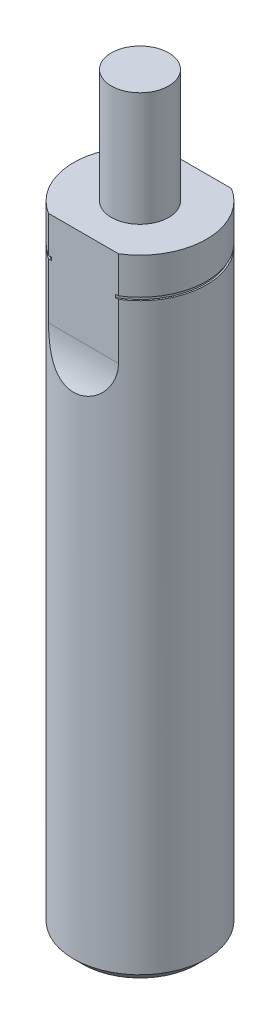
ISO-10303-21;
HEADER;
FILE_DESCRIPTION(('STEP AP214'),'2;1');
FILE_NAME('part.step','',(''),(''),'','','');
FILE_SCHEMA(('AUTOMOTIVE_DESIGN { 1 0 10303 214 1 1 1 1 }'));
ENDSEC;
DATA;
#1=APPLICATION_CONTEXT('core data for automotive mechanical design processes');
#2=APPLICATION_PROTOCOL_DEFINITION('international standard','automotive_design',2000,#1);
#3=PRODUCT_CONTEXT('',#1,'mechanical');
#4=PRODUCT('Part','Part','',(#3));
#5=PRODUCT_RELATED_PRODUCT_CATEGORY('part','',(#4));
#6=PRODUCT_DEFINITION_FORMATION('','',#4);
#7=PRODUCT_DEFINITION_CONTEXT('part definition',#1,'design');
#8=PRODUCT_DEFINITION('design','',#6,#7);
#9=PRODUCT_DEFINITION_SHAPE('','',#8);
#10=(LENGTH_UNIT() NAMED_UNIT(*) SI_UNIT(.MILLI.,.METRE.));
#11=(NAMED_UNIT(*) PLANE_ANGLE_UNIT() SI_UNIT($,.RADIAN.));
#12=(NAMED_UNIT(*) SI_UNIT($,.STERADIAN.) SOLID_ANGLE_UNIT());
#13=UNCERTAINTY_MEASURE_WITH_UNIT(LENGTH_MEASURE(1.E-05),#10,'distance_accuracy_value','');
#14=(GEOMETRIC_REPRESENTATION_CONTEXT(3) GLOBAL_UNCERTAINTY_ASSIGNED_CONTEXT((#13)) GLOBAL_UNIT_ASSIGNED_CONTEXT((#10,
#11,#12)) REPRESENTATION_CONTEXT('',''));
#15=CARTESIAN_POINT('',(0.,0.,0.));
#16=DIRECTION('',(0.,0.,1.));
#17=DIRECTION('',(1.,0.,0.));
#18=AXIS2_PLACEMENT_3D('',#15,#16,#17);
#19=CARTESIAN_POINT('',(0.,52.9082,0.));
#20=DIRECTION('',(0.,-1.,0.));
#21=DIRECTION('',(0.,0.,-1.));
#22=AXIS2_PLACEMENT_3D('',#19,#20,#21);
#23=CYLINDRICAL_SURFACE('',#22,5.55625);
#24=CARTESIAN_POINT('',(0.,0.793750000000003,0.));
#25=DIRECTION('',(0.,1.,0.));
#26=DIRECTION('',(0.,0.,1.));
#27=AXIS2_PLACEMENT_3D('',#24,#25,#26);
#28=CIRCLE('',#27,5.55625);
#29=CARTESIAN_POINT('',(0.,0.793750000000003,5.55625));
#30=VERTEX_POINT('',#29);
#31=EDGE_CURVE('E40',#30,#30,#28,.T.);
#32=ORIENTED_EDGE('',*,*,#31,.T.);
#33=EDGE_LOOP('',(#32));
#34=FACE_BOUND('',#33,.T.);
#35=DIRECTION('',(0.,-1.,0.));
#36=VECTOR('',#35,1.);
#37=CARTESIAN_POINT('',(2.92437321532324,52.9082,-4.7244));
#38=LINE('',#37,#36);
#39=CARTESIAN_POINT('',(2.92437321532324,44.9707,-4.7244));
#40=VERTEX_POINT('',#39);
#41=CARTESIAN_POINT('',(2.92437321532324,49.6062,-4.7244));
#42=VERTEX_POINT('',#41);
#43=EDGE_CURVE('E176',#40,#42,#38,.F.);
#44=ORIENTED_EDGE('',*,*,#43,.T.);
#45=CARTESIAN_POINT('',(0.,49.6062,0.));
#46=DIRECTION('',(0.,-1.,0.));
#47=DIRECTION('',(0.,0.,-1.));
#48=AXIS2_PLACEMENT_3D('',#45,#46,#47);
#49=CIRCLE('',#48,5.55625);
#50=CARTESIAN_POINT('',(2.92437321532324,49.6062,4.7244));
#51=VERTEX_POINT('',#50);
#52=EDGE_CURVE('E146',#42,#51,#49,.T.);
#53=ORIENTED_EDGE('',*,*,#52,.T.);
#54=DIRECTION('',(0.,-1.,0.));
#55=VECTOR('',#54,1.);
#56=CARTESIAN_POINT('',(2.92437321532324,52.9082,4.7244));
#57=LINE('',#56,#55);
#58=CARTESIAN_POINT('',(2.92437321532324,44.9707,4.7244));
#59=VERTEX_POINT('',#58);
#60=EDGE_CURVE('E276',#51,#59,#57,.T.);
#61=ORIENTED_EDGE('',*,*,#60,.T.);
#62=CARTESIAN_POINT('',(-2.92437321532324,44.9707,4.7244));
#63=CARTESIAN_POINT('',(-2.92437357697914,45.1465694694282,4.7244066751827));
#64=CARTESIAN_POINT('',(-2.9125849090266,45.3225270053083,4.73176007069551));
#65=CARTESIAN_POINT('',(-2.86515397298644,45.6701491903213,4.76062580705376));
#66=CARTESIAN_POINT('',(-2.82949078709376,45.8418099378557,4.78215056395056));
#67=CARTESIAN_POINT('',(-2.73358599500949,46.1764199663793,4.83761206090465));
#68=CARTESIAN_POINT('',(-2.67330208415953,46.3393537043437,4.87157015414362));
#69=CARTESIAN_POINT('',(-2.52764479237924,46.6512232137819,4.94870519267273));
#70=CARTESIAN_POINT('',(-2.4422819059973,46.8001648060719,4.99187827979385));
#71=CARTESIAN_POINT('',(-2.24736833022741,47.0782932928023,5.08258637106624));
#72=CARTESIAN_POINT('',(-2.1379810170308,47.2076040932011,5.13009070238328));
#73=CARTESIAN_POINT('',(-1.89643821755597,47.4432865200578,5.22418946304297));
#74=CARTESIAN_POINT('',(-1.76429080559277,47.5496662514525,5.2707842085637));
#75=CARTESIAN_POINT('',(-1.49144964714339,47.7292582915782,5.35408923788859));
#76=CARTESIAN_POINT('',(-1.3521446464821,47.8043624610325,5.39127921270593));
#77=CARTESIAN_POINT('',(-1.06102493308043,47.9306947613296,5.45603699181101));
#78=CARTESIAN_POINT('',(-0.909212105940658,47.9819264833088,5.48360624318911));
#79=CARTESIAN_POINT('',(-0.603842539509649,48.0582552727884,5.52540635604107));
#80=CARTESIAN_POINT('',(-0.450585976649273,48.0842957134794,5.54011651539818));
#81=CARTESIAN_POINT('',(-0.141222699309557,48.1134411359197,5.55661357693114));
#82=CARTESIAN_POINT('',(0.0148838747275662,48.1165472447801,5.55840111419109));
#83=CARTESIAN_POINT('',(0.324473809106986,48.0998552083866,5.54891600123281));
#84=CARTESIAN_POINT('',(0.477967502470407,48.0802013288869,5.53772561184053));
#85=CARTESIAN_POINT('',(0.778964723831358,48.0183815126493,5.50345990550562));
#86=CARTESIAN_POINT('',(0.926468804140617,47.9762176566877,5.48038568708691));
#87=CARTESIAN_POINT('',(1.21138937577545,47.8698499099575,5.42453149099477));
#88=CARTESIAN_POINT('',(1.34880290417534,47.8056395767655,5.39174867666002));
#89=CARTESIAN_POINT('',(1.60981031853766,47.6562737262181,5.31965944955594));
#90=CARTESIAN_POINT('',(1.73340484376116,47.5711191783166,5.28035333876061));
#91=CARTESIAN_POINT('',(1.96521224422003,47.38067418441,5.19857267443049));
#92=CARTESIAN_POINT('',(2.07323828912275,47.2751698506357,5.15606768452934));
#93=CARTESIAN_POINT('',(2.27040287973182,47.0473692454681,5.07234556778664));
#94=CARTESIAN_POINT('',(2.35953739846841,46.9250694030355,5.03112871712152));
#95=CARTESIAN_POINT('',(2.52176099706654,46.6610152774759,4.95188692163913));
#96=CARTESIAN_POINT('',(2.59392913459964,46.5186268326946,4.91409436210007));
#97=CARTESIAN_POINT('',(2.71679007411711,46.2229582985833,4.84725379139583));
#98=CARTESIAN_POINT('',(2.7674747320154,46.0696741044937,4.81820909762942));
#99=CARTESIAN_POINT('',(2.85087623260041,45.7441689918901,4.76937689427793));
#100=CARTESIAN_POINT('',(2.88193926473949,45.5713934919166,4.75045829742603));
#101=CARTESIAN_POINT('',(2.92030459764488,45.2222424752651,4.7269686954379));
#102=CARTESIAN_POINT('',(2.92759749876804,45.0458655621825,4.72240336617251));
#103=CARTESIAN_POINT('',(2.91830118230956,44.6837365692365,4.72815891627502));
#104=CARTESIAN_POINT('',(2.90030750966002,44.4980317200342,4.7393552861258));
#105=CARTESIAN_POINT('',(2.83745730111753,44.1328071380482,4.77724658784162));
#106=CARTESIAN_POINT('',(2.79259921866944,43.9532877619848,4.80394241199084));
#107=CARTESIAN_POINT('',(2.67555375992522,43.6068841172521,4.87009291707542));
#108=CARTESIAN_POINT('',(2.60350989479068,43.4399389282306,4.90948044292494));
#109=CARTESIAN_POINT('',(2.43167949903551,43.1234619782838,4.99680665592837));
#110=CARTESIAN_POINT('',(2.33190910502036,42.9739201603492,5.04474036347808));
#111=CARTESIAN_POINT('',(2.11321739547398,42.7070865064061,5.13998268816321));
#112=CARTESIAN_POINT('',(1.99604770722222,42.5882975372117,5.1871143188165));
#113=CARTESIAN_POINT('',(1.74074728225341,42.374395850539,5.27825808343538));
#114=CARTESIAN_POINT('',(1.60262546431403,42.2792731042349,5.32227153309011));
#115=CARTESIAN_POINT('',(1.3201414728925,42.121265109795,5.39897894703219));
#116=CARTESIAN_POINT('',(1.1769679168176,42.0565355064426,5.4322641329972));
#117=CARTESIAN_POINT('',(0.880165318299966,41.9507447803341,5.48816896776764));
#118=CARTESIAN_POINT('',(0.726537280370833,41.9096813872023,5.51078963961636));
#119=CARTESIAN_POINT('',(0.418236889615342,41.8525911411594,5.54258858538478));
#120=CARTESIAN_POINT('',(0.26373704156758,41.8358437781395,5.55215318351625));
#121=CARTESIAN_POINT('',(-0.0463012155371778,41.8251805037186,5.55821935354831));
#122=CARTESIAN_POINT('',(-0.201839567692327,41.8312633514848,5.55472163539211));
#123=CARTESIAN_POINT('',(-0.508961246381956,41.8661573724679,5.53502221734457));
#124=CARTESIAN_POINT('',(-0.660556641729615,41.8948878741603,5.51886560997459));
#125=CARTESIAN_POINT('',(-0.956051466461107,41.9747145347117,5.47541628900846));
#126=CARTESIAN_POINT('',(-1.09995162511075,42.0258085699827,5.44812463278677));
#127=CARTESIAN_POINT('',(-1.37621358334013,42.14973076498,5.38498490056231));
#128=CARTESIAN_POINT('',(-1.50856348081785,42.2225810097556,5.3491281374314));
#129=CARTESIAN_POINT('',(-1.75815838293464,42.3885966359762,5.27236820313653));
#130=CARTESIAN_POINT('',(-1.87540401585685,42.4817611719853,5.23146524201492));
#131=CARTESIAN_POINT('',(-2.09411253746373,42.6878781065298,5.14786995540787));
#132=CARTESIAN_POINT('',(-2.19528765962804,42.8011277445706,5.10515934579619));
#133=CARTESIAN_POINT('',(-2.37811663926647,43.0433558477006,5.02260592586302));
#134=CARTESIAN_POINT('',(-2.45976172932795,43.1723413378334,4.9827644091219));
#135=CARTESIAN_POINT('',(-2.60695950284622,43.44991271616,4.90743346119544));
#136=CARTESIAN_POINT('',(-2.67140051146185,43.5991819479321,4.87229682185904));
#137=CARTESIAN_POINT('',(-2.77833602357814,43.9072069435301,4.81212509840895));
#138=CARTESIAN_POINT('',(-2.8208400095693,44.0659585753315,4.78708565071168));
#139=CARTESIAN_POINT('',(-2.8766454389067,44.349232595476,4.75369094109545));
#140=CARTESIAN_POINT('',(-2.89455737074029,44.472574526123,4.74274727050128));
#141=CARTESIAN_POINT('',(-2.91842126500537,44.7208294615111,4.72809934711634));
#142=CARTESIAN_POINT('',(-2.92437295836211,44.8457425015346,4.72439525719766));
#143=CARTESIAN_POINT('',(-2.92437321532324,44.9707,4.7244));
#144=B_SPLINE_CURVE_WITH_KNOTS('',3,(#62,#63,#64,#65,#66,#67,#68,#69,#70,#71,#72,#73,#74,#75,
#76,#77,#78,#79,#80,#81,#82,#83,#84,#85,#86,#87,#88,#89,#90,#91,#92,#93,#94,#95,#96,#97,#98,#99,
#100,#101,#102,#103,#104,#105,#106,#107,#108,#109,#110,#111,#112,#113,#114,#115,#116,#117,#118,
#119,#120,#121,#122,#123,#124,#125,#126,#127,#128,#129,#130,#131,#132,#133,#134,#135,#136,#137,
#138,#139,#140,#141,#142,#143),.UNSPECIFIED.,.T.,.F.,(4,2,2,2,2,2,2,2,2,2,2,2,2,2,2,2,2,2,2,2,2,
2,2,2,2,2,2,2,2,2,2,2,2,2,2,2,2,2,2,2,4),(0.,0.527209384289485,1.05488129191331,
1.58346371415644,2.11182526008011,2.63669923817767,3.16138739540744,3.64664185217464,
4.13182328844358,4.59803781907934,5.06422943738,5.52748216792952,5.99069208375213,
6.45403747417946,6.91736142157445,7.38585039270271,7.85443912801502,8.34447159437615,
8.83468965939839,9.36207837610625,9.88967561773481,10.4477616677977,11.0058798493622,
11.5610920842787,12.1159818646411,12.633342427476,13.1504833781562,13.6299314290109,
14.1093334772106,14.5742180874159,15.0390774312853,15.5022883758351,15.9654553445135,
16.4290940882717,16.8927135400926,17.3638747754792,17.835247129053,18.3321607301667,
18.8288593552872,19.203439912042,19.5780288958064),.UNSPECIFIED.);
#145=CARTESIAN_POINT('',(-2.92437321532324,44.9707,4.7244));
#146=VERTEX_POINT('',#145);
#147=EDGE_CURVE('E277',#59,#146,#144,.T.);
#148=ORIENTED_EDGE('',*,*,#147,.T.);
#149=DIRECTION('',(0.,-1.,0.));
#150=VECTOR('',#149,1.);
#151=CARTESIAN_POINT('',(-2.92437321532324,52.9082,4.7244));
#152=LINE('',#151,#150);
#153=CARTESIAN_POINT('',(-2.92437321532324,49.6062,4.7244));
#154=VERTEX_POINT('',#153);
#155=EDGE_CURVE('E255',#146,#154,#152,.F.);
#156=ORIENTED_EDGE('',*,*,#155,.T.);
#157=CARTESIAN_POINT('',(-2.92437321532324,49.6062,-4.7244));
#158=VERTEX_POINT('',#157);
#159=EDGE_CURVE('E239',#154,#158,#49,.T.);
#160=ORIENTED_EDGE('',*,*,#159,.T.);
#161=DIRECTION('',(0.,-1.,0.));
#162=VECTOR('',#161,1.);
#163=CARTESIAN_POINT('',(-2.92437321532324,52.9082,-4.7244));
#164=LINE('',#163,#162);
#165=CARTESIAN_POINT('',(-2.92437321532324,44.9707,-4.7244));
#166=VERTEX_POINT('',#165);
#167=EDGE_CURVE('E185',#158,#166,#164,.T.);
#168=ORIENTED_EDGE('',*,*,#167,.T.);
#169=CARTESIAN_POINT('',(0.,48.1127567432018,-5.55625));
#170=CARTESIAN_POINT('',(-0.16184301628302,48.1127524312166,-5.55624008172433));
#171=CARTESIAN_POINT('',(-0.3238657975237,48.1003134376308,-5.54910680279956));
#172=CARTESIAN_POINT('',(-0.64304583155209,48.0505982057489,-5.52124723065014));
#173=CARTESIAN_POINT('',(-0.800194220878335,48.0132792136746,-5.50049753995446));
#174=CARTESIAN_POINT('',(-1.10442260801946,47.9142295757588,-5.44756580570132));
#175=CARTESIAN_POINT('',(-1.25151123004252,47.852520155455,-5.41539370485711));
#176=CARTESIAN_POINT('',(-1.53125541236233,47.7057761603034,-5.34303861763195));
#177=CARTESIAN_POINT('',(-1.66391899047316,47.6207546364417,-5.30286011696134));
#178=CARTESIAN_POINT('',(-1.90681674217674,47.4329055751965,-5.22032965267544));
#179=CARTESIAN_POINT('',(-2.01769920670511,47.3308532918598,-5.17811311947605));
#180=CARTESIAN_POINT('',(-2.2209059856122,47.1095192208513,-5.09427133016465));
#181=CARTESIAN_POINT('',(-2.31322781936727,46.9902351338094,-5.0526461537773));
#182=CARTESIAN_POINT('',(-2.48187123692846,46.7322144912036,-4.97205828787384));
#183=CARTESIAN_POINT('',(-2.55734474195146,46.5928661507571,-4.93328428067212));
#184=CARTESIAN_POINT('',(-2.68700080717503,46.3027140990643,-4.86388347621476));
#185=CARTESIAN_POINT('',(-2.74117510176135,46.1519059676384,-4.83325984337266));
#186=CARTESIAN_POINT('',(-2.83190980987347,45.8310972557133,-4.78070911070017));
#187=CARTESIAN_POINT('',(-2.8668523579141,45.6605044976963,-4.75960242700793));
#188=CARTESIAN_POINT('',(-2.91320994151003,45.3150001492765,-4.73136886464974));
#189=CARTESIAN_POINT('',(-2.92461561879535,45.1400868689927,-4.72424754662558));
#190=CARTESIAN_POINT('',(-2.92410787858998,44.7794914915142,-4.72456679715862));
#191=CARTESIAN_POINT('',(-2.91071509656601,44.5938095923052,-4.7329311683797));
#192=CARTESIAN_POINT('',(-2.85733623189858,44.2276647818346,-4.76534447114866));
#193=CARTESIAN_POINT('',(-2.81734718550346,44.0472024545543,-4.78939515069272));
#194=CARTESIAN_POINT('',(-2.70996767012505,43.6967429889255,-4.85095996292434));
#195=CARTESIAN_POINT('',(-2.64254656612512,43.5267577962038,-4.88848914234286));
#196=CARTESIAN_POINT('',(-2.47977257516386,43.2033094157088,-4.97302711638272));
#197=CARTESIAN_POINT('',(-2.38443495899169,43.0498372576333,-5.02003072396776));
#198=CARTESIAN_POINT('',(-2.17343135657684,42.7741384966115,-5.11473992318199));
#199=CARTESIAN_POINT('',(-2.0594507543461,42.6505429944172,-5.1622093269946));
#200=CARTESIAN_POINT('',(-1.80966659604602,42.4268017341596,-5.25496818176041));
#201=CARTESIAN_POINT('',(-1.67387321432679,42.3266450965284,-5.30025863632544));
#202=CARTESIAN_POINT('',(-1.39521071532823,42.159186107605,-5.38002734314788));
#203=CARTESIAN_POINT('',(-1.25364185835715,42.0899793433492,-5.41506258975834));
#204=CARTESIAN_POINT('',(-0.959160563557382,41.9753290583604,-5.47489432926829));
#205=CARTESIAN_POINT('',(-0.806249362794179,41.9298829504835,-5.49969193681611));
#206=CARTESIAN_POINT('',(-0.49908802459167,41.8644776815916,-5.53587684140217));
#207=CARTESIAN_POINT('',(-0.34506106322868,41.8437028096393,-5.54769230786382));
#208=CARTESIAN_POINT('',(-0.035184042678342,41.825026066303,-5.55830021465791));
#209=CARTESIAN_POINT('',(0.1206659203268,41.8271229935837,-5.55709333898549));
#210=CARTESIAN_POINT('',(0.429009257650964,41.8541138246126,-5.54180362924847));
#211=CARTESIAN_POINT('',(0.581514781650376,41.8789027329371,-5.5277800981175));
#212=CARTESIAN_POINT('',(0.879565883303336,41.9509169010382,-5.48824911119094));
#213=CARTESIAN_POINT('',(1.02511214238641,41.9981399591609,-5.46274278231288));
#214=CARTESIAN_POINT('',(1.30527948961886,42.1144609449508,-5.40265785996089));
#215=CARTESIAN_POINT('',(1.43989343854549,42.1835730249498,-5.3680733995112));
#216=CARTESIAN_POINT('',(1.69456253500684,42.3424016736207,-5.29320429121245));
#217=CARTESIAN_POINT('',(1.81461802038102,42.432117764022,-5.25291977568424));
#218=CARTESIAN_POINT('',(2.03909906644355,42.6314845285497,-5.16996487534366));
#219=CARTESIAN_POINT('',(2.14328333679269,42.7413957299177,-5.12726905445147));
#220=CARTESIAN_POINT('',(2.33238198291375,42.977403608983,-5.0440669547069));
#221=CARTESIAN_POINT('',(2.41729170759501,43.1035041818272,-5.00356120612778));
#222=CARTESIAN_POINT('',(2.5710408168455,43.3752191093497,-4.92640433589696));
#223=CARTESIAN_POINT('',(2.6388551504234,43.5214964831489,-4.89005019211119));
#224=CARTESIAN_POINT('',(2.75277286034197,43.8241992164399,-4.82684250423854));
#225=CARTESIAN_POINT('',(2.79886782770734,43.9806284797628,-4.79999264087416));
#226=CARTESIAN_POINT('',(2.87257244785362,44.3119781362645,-4.75628464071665));
#227=CARTESIAN_POINT('',(2.89849399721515,44.4873967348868,-4.74035033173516));
#228=CARTESIAN_POINT('',(2.92625982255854,44.8408682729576,-4.72325887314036));
#229=CARTESIAN_POINT('',(2.92809485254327,45.0189221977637,-4.7221073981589));
#230=CARTESIAN_POINT('',(2.90717540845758,45.3824312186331,-4.73502111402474));
#231=CARTESIAN_POINT('',(2.88312982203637,45.5677863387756,-4.74988532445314));
#232=CARTESIAN_POINT('',(2.80784529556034,45.931032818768,-4.79477069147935));
#233=CARTESIAN_POINT('',(2.75660662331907,46.108924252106,-4.82479169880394));
#234=CARTESIAN_POINT('',(2.62704287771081,46.4492745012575,-4.89652384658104));
#235=CARTESIAN_POINT('',(2.54909043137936,46.6119083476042,-4.93807274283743));
#236=CARTESIAN_POINT('',(2.36579491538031,46.9186558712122,-5.02844913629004));
#237=CARTESIAN_POINT('',(2.26047045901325,47.0627820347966,-5.07727167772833));
#238=CARTESIAN_POINT('',(2.03228660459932,47.3177318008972,-5.17260565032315));
#239=CARTESIAN_POINT('',(1.91123611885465,47.4302061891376,-5.21903032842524));
#240=CARTESIAN_POINT('',(1.64928652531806,47.6313111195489,-5.30761846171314));
#241=CARTESIAN_POINT('',(1.50838750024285,47.7199417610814,-5.34978193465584));
#242=CARTESIAN_POINT('',(1.22124436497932,47.8658704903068,-5.42225934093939));
#243=CARTESIAN_POINT('',(1.07603114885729,47.9249017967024,-5.45318801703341));
#244=CARTESIAN_POINT('',(0.776439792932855,48.0193121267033,-5.50381923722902));
#245=CARTESIAN_POINT('',(0.622078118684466,48.0547323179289,-5.5235413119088));
#246=CARTESIAN_POINT('',(0.388680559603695,48.0897134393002,-5.54317965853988));
#247=CARTESIAN_POINT('',(0.311293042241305,48.0983500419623,-5.54806747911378));
#248=CARTESIAN_POINT('',(0.155950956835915,48.1098729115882,-5.55460514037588));
#249=CARTESIAN_POINT('',(0.077996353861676,48.1127588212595,-5.5562547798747));
#250=CARTESIAN_POINT('',(0.,48.1127567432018,-5.55625));
#251=B_SPLINE_CURVE_WITH_KNOTS('',3,(#169,#170,#171,#172,#173,#174,#175,#176,#177,#178,#179,
#180,#181,#182,#183,#184,#185,#186,#187,#188,#189,#190,#191,#192,#193,#194,#195,#196,#197,#198,
#199,#200,#201,#202,#203,#204,#205,#206,#207,#208,#209,#210,#211,#212,#213,#214,#215,#216,#217,
#218,#219,#220,#221,#222,#223,#224,#225,#226,#227,#228,#229,#230,#231,#232,#233,#234,#235,#236,
#237,#238,#239,#240,#241,#242,#243,#244,#245,#246,#247,#248,#249,#250),.UNSPECIFIED.,.T.,.F.,(4,
2,2,2,2,2,2,2,2,2,2,2,2,2,2,2,2,2,2,2,2,2,2,2,2,2,2,2,2,2,2,2,2,2,2,2,2,2,2,2,4),(0.,
0.485211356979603,0.971258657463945,1.45688390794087,1.94223784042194,2.40963293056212,
2.87709044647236,3.36444061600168,3.85197972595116,4.37593442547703,4.9000974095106,
5.45654096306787,6.01304653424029,6.5701753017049,7.12699987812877,7.6482927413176,
8.16934315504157,8.65120587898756,9.1330161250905,9.59840845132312,10.0637763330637,
10.5270017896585,10.9901817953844,11.4536618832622,11.9171312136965,12.3870632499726,
12.8571085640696,13.3508331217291,13.8447486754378,14.3765303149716,14.9085160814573,
15.4683260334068,16.0281304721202,16.580424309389,17.1323435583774,17.6445179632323,
18.156690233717,18.6337034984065,19.1098828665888,19.3437042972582,19.5775402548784),.UNSPECIFIED.);
#252=EDGE_CURVE('E179',#166,#40,#251,.T.);
#253=ORIENTED_EDGE('',*,*,#252,.T.);
#254=EDGE_LOOP('',(#44,#53,#61,#148,#156,#160,#168,#253));
#255=FACE_BOUND('',#254,.T.);
#256=ADVANCED_FACE('F32',(#34,#255),#23,.T.);
#257=CARTESIAN_POINT('',(2.92437321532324,52.9082,4.7244));
#258=VERTEX_POINT('',#257);
#259=CARTESIAN_POINT('',(2.92437321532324,49.8602,4.7244));
#260=VERTEX_POINT('',#259);
#261=EDGE_CURVE('E273',#258,#260,#57,.T.);
#262=ORIENTED_EDGE('',*,*,#261,.T.);
#263=CARTESIAN_POINT('',(0.,49.8602,0.));
#264=DIRECTION('',(0.,-1.,0.));
#265=DIRECTION('',(0.,0.,-1.));
#266=AXIS2_PLACEMENT_3D('',#263,#264,#265);
#267=CIRCLE('',#266,5.55625);
#268=CARTESIAN_POINT('',(2.92437321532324,49.8602,-4.7244));
#269=VERTEX_POINT('',#268);
#270=EDGE_CURVE('E55',#269,#260,#267,.T.);
#271=ORIENTED_EDGE('',*,*,#270,.F.);
#272=CARTESIAN_POINT('',(2.92437321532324,52.9082,-4.7244));
#273=VERTEX_POINT('',#272);
#274=EDGE_CURVE('E142',#269,#273,#38,.F.);
#275=ORIENTED_EDGE('',*,*,#274,.T.);
#276=CARTESIAN_POINT('',(0.,52.9082,0.));
#277=DIRECTION('',(0.,1.,0.));
#278=DIRECTION('',(0.,0.,1.));
#279=AXIS2_PLACEMENT_3D('',#276,#277,#278);
#280=CIRCLE('',#279,5.55625);
#281=EDGE_CURVE('E170',#258,#273,#280,.T.);
#282=ORIENTED_EDGE('',*,*,#281,.F.);
#283=EDGE_LOOP('',(#262,#271,#275,#282));
#284=FACE_BOUND('',#283,.T.);
#285=ADVANCED_FACE('F213',(#284),#23,.T.);
#286=CARTESIAN_POINT('',(0.,52.9082,0.));
#287=DIRECTION('',(0.,1.,0.));
#288=DIRECTION('',(0.,0.,1.));
#289=AXIS2_PLACEMENT_3D('',#286,#287,#288);
#290=PLANE('',#289);
#291=DIRECTION('',(1.,0.,0.));
#292=VECTOR('',#291,1.);
#293=CARTESIAN_POINT('',(-5.55625,52.9082,4.7244));
#294=LINE('',#293,#292);
#295=CARTESIAN_POINT('',(-2.92437321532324,52.9082,4.7244));
#296=VERTEX_POINT('',#295);
#297=EDGE_CURVE('E155',#296,#258,#294,.T.);
#298=ORIENTED_EDGE('',*,*,#297,.T.);
#299=ORIENTED_EDGE('',*,*,#281,.T.);
#300=DIRECTION('',(1.,0.,0.));
#301=VECTOR('',#300,1.);
#302=CARTESIAN_POINT('',(-5.55625,52.9082,-4.7244));
#303=LINE('',#302,#301);
#304=CARTESIAN_POINT('',(-2.92437321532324,52.9082,-4.7244));
#305=VERTEX_POINT('',#304);
#306=EDGE_CURVE('E158',#305,#273,#303,.T.);
#307=ORIENTED_EDGE('',*,*,#306,.F.);
#308=EDGE_CURVE('E173',#305,#296,#280,.T.);
#309=ORIENTED_EDGE('',*,*,#308,.T.);
#310=EDGE_LOOP('',(#298,#299,#307,#309));
#311=FACE_BOUND('',#310,.T.);
#312=CARTESIAN_POINT('',(0.,52.9082,0.));
#313=DIRECTION('',(0.,1.,0.));
#314=DIRECTION('',(0.,0.,1.));
#315=AXIS2_PLACEMENT_3D('',#312,#313,#314);
#316=CIRCLE('',#315,2.39776);
#317=CARTESIAN_POINT('',(0.,52.9082,-2.39776));
#318=VERTEX_POINT('',#317);
#319=EDGE_CURVE('E165',#318,#318,#316,.T.);
#320=ORIENTED_EDGE('',*,*,#319,.F.);
#321=EDGE_LOOP('',(#320));
#322=FACE_BOUND('',#321,.T.);
#323=ADVANCED_FACE('F211',(#311,#322),#290,.T.);
#324=CARTESIAN_POINT('',(-2.92437321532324,49.8602,-4.7244));
#325=VERTEX_POINT('',#324);
#326=EDGE_CURVE('E186',#305,#325,#164,.T.);
#327=ORIENTED_EDGE('',*,*,#326,.T.);
#328=CARTESIAN_POINT('',(-2.92437321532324,49.8602,4.7244));
#329=VERTEX_POINT('',#328);
#330=EDGE_CURVE('E244',#329,#325,#267,.T.);
#331=ORIENTED_EDGE('',*,*,#330,.F.);
#332=EDGE_CURVE('E254',#329,#296,#152,.F.);
#333=ORIENTED_EDGE('',*,*,#332,.T.);
#334=ORIENTED_EDGE('',*,*,#308,.F.);
#335=EDGE_LOOP('',(#327,#331,#333,#334));
#336=FACE_BOUND('',#335,.T.);
#337=ADVANCED_FACE('F188',(#336),#23,.T.);
#338=CARTESIAN_POINT('',(0.,0.,0.));
#339=DIRECTION('',(0.,1.,0.));
#340=DIRECTION('',(0.,0.,1.));
#341=AXIS2_PLACEMENT_3D('',#338,#339,#340);
#342=PLANE('',#341);
#343=CARTESIAN_POINT('',(0.,0.,0.));
#344=DIRECTION('',(0.,1.,0.));
#345=DIRECTION('',(0.,0.,1.));
#346=AXIS2_PLACEMENT_3D('',#343,#344,#345);
#347=CIRCLE('',#346,4.76249999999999);
#348=CARTESIAN_POINT('',(0.,0.,4.76249999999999));
#349=VERTEX_POINT('',#348);
#350=EDGE_CURVE('E11',#349,#349,#347,.F.);
#351=ORIENTED_EDGE('',*,*,#350,.T.);
#352=EDGE_LOOP('',(#351));
#353=FACE_BOUND('',#352,.T.);
#354=ADVANCED_FACE('F209',(#353),#342,.F.);
#355=CARTESIAN_POINT('',(0.,62.4332,0.));
#356=DIRECTION('',(0.,-1.,0.));
#357=DIRECTION('',(0.,0.,-1.));
#358=AXIS2_PLACEMENT_3D('',#355,#356,#357);
#359=CYLINDRICAL_SURFACE('',#358,2.39776);
#360=CARTESIAN_POINT('',(0.,62.4332,0.));
#361=DIRECTION('',(0.,1.,0.));
#362=DIRECTION('',(0.,0.,1.));
#363=AXIS2_PLACEMENT_3D('',#360,#361,#362);
#364=CIRCLE('',#363,2.39776);
#365=CARTESIAN_POINT('',(0.,62.4332,-2.39776));
#366=VERTEX_POINT('',#365);
#367=EDGE_CURVE('E167',#366,#366,#364,.T.);
#368=CARTESIAN_POINT('',(0.,62.4332,-2.39776));
#369=CARTESIAN_POINT('',(0.,62.33398125,-2.39776));
#370=CARTESIAN_POINT('',(0.,62.2347625,-2.39776));
#371=CARTESIAN_POINT('',(0.,62.036325,-2.39776));
#372=CARTESIAN_POINT('',(0.,61.93710625,-2.39776));
#373=CARTESIAN_POINT('',(0.,61.73866875,-2.39776));
#374=CARTESIAN_POINT('',(0.,61.63945,-2.39776));
#375=CARTESIAN_POINT('',(0.,61.4410125,-2.39776));
#376=CARTESIAN_POINT('',(0.,61.34179375,-2.39776));
#377=CARTESIAN_POINT('',(0.,61.14335625,-2.39776));
#378=CARTESIAN_POINT('',(0.,61.0441375,-2.39776));
#379=CARTESIAN_POINT('',(0.,60.8457,-2.39776));
#380=CARTESIAN_POINT('',(0.,60.74648125,-2.39776));
#381=CARTESIAN_POINT('',(0.,60.54804375,-2.39776));
#382=CARTESIAN_POINT('',(0.,60.448825,-2.39776));
#383=CARTESIAN_POINT('',(0.,60.2503875,-2.39776));
#384=CARTESIAN_POINT('',(0.,60.15116875,-2.39776));
#385=CARTESIAN_POINT('',(0.,59.95273125,-2.39776));
#386=CARTESIAN_POINT('',(0.,59.8535125,-2.39776));
#387=CARTESIAN_POINT('',(0.,59.655075,-2.39776));
#388=CARTESIAN_POINT('',(0.,59.55585625,-2.39776));
#389=CARTESIAN_POINT('',(0.,59.35741875,-2.39776));
#390=CARTESIAN_POINT('',(0.,59.2582,-2.39776));
#391=CARTESIAN_POINT('',(0.,59.0597625,-2.39776));
#392=CARTESIAN_POINT('',(0.,58.96054375,-2.39776));
#393=CARTESIAN_POINT('',(0.,58.76210625,-2.39776));
#394=CARTESIAN_POINT('',(0.,58.6628875,-2.39776));
#395=CARTESIAN_POINT('',(0.,58.46445,-2.39776));
#396=CARTESIAN_POINT('',(0.,58.36523125,-2.39776));
#397=CARTESIAN_POINT('',(0.,58.16679375,-2.39776));
#398=CARTESIAN_POINT('',(0.,58.067575,-2.39776));
#399=CARTESIAN_POINT('',(0.,57.8691375,-2.39776));
#400=CARTESIAN_POINT('',(0.,57.76991875,-2.39776));
#401=CARTESIAN_POINT('',(0.,57.57148125,-2.39776));
#402=CARTESIAN_POINT('',(0.,57.4722625,-2.39776));
#403=CARTESIAN_POINT('',(0.,57.273825,-2.39776));
#404=CARTESIAN_POINT('',(0.,57.17460625,-2.39776));
#405=CARTESIAN_POINT('',(0.,56.97616875,-2.39776));
#406=CARTESIAN_POINT('',(0.,56.87695,-2.39776));
#407=CARTESIAN_POINT('',(0.,56.6785125,-2.39776));
#408=CARTESIAN_POINT('',(0.,56.57929375,-2.39776));
#409=CARTESIAN_POINT('',(0.,56.38085625,-2.39776));
#410=CARTESIAN_POINT('',(0.,56.2816375,-2.39776));
#411=CARTESIAN_POINT('',(0.,56.0832,-2.39776));
#412=CARTESIAN_POINT('',(0.,55.98398125,-2.39776));
#413=CARTESIAN_POINT('',(0.,55.78554375,-2.39776));
#414=CARTESIAN_POINT('',(0.,55.686325,-2.39776));
#415=CARTESIAN_POINT('',(0.,55.4878875,-2.39776));
#416=CARTESIAN_POINT('',(0.,55.38866875,-2.39776));
#417=CARTESIAN_POINT('',(0.,55.19023125,-2.39776));
#418=CARTESIAN_POINT('',(0.,55.0910125,-2.39776));
#419=CARTESIAN_POINT('',(0.,54.892575,-2.39776));
#420=CARTESIAN_POINT('',(0.,54.79335625,-2.39776));
#421=CARTESIAN_POINT('',(0.,54.59491875,-2.39776));
#422=CARTESIAN_POINT('',(0.,54.4957,-2.39776));
#423=CARTESIAN_POINT('',(0.,54.2972625,-2.39776));
#424=CARTESIAN_POINT('',(0.,54.19804375,-2.39776));
#425=CARTESIAN_POINT('',(0.,53.99960625,-2.39776));
#426=CARTESIAN_POINT('',(0.,53.9003875,-2.39776));
#427=CARTESIAN_POINT('',(0.,53.70195,-2.39776));
#428=CARTESIAN_POINT('',(0.,53.60273125,-2.39776));
#429=CARTESIAN_POINT('',(0.,53.40429375,-2.39776));
#430=CARTESIAN_POINT('',(0.,53.305075,-2.39776));
#431=CARTESIAN_POINT('',(0.,53.1066375,-2.39776));
#432=CARTESIAN_POINT('',(0.,53.00741875,-2.39776));
#433=CARTESIAN_POINT('',(0.,52.9082,-2.39776));
#434=B_SPLINE_CURVE_WITH_KNOTS('',3,(#368,#369,#370,#371,#372,#373,#374,#375,#376,#377,#378,
#379,#380,#381,#382,#383,#384,#385,#386,#387,#388,#389,#390,#391,#392,#393,#394,#395,#396,#397,
#398,#399,#400,#401,#402,#403,#404,#405,#406,#407,#408,#409,#410,#411,#412,#413,#414,#415,#416,
#417,#418,#419,#420,#421,#422,#423,#424,#425,#426,#427,#428,#429,#430,#431,#432,#433),
.UNSPECIFIED.,.F.,.F.,(4,2,2,2,2,2,2,2,2,2,2,2,2,2,2,2,2,2,2,2,2,2,2,2,2,2,2,2,2,2,2,2,4),(0.,
0.29765625,0.5953125,0.892968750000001,1.190625,1.48828125,1.7859375,2.08359375,2.38125,
2.67890625,2.9765625,3.27421875,3.571875,3.86953125,4.1671875,4.46484375,4.7625,5.06015625,
5.3578125,5.65546875,5.953125,6.25078125,6.5484375,6.84609375,7.14375,7.44140625,7.7390625,
8.03671875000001,8.334375,8.63203125,8.92968750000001,9.22734375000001,9.52500000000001),.UNSPECIFIED.);
#435=EDGE_CURVE('BSEAM205',#366,#318,#434,.T.);
#436=ORIENTED_EDGE('',*,*,#367,.F.);
#437=ORIENTED_EDGE('',*,*,#319,.T.);
#438=ORIENTED_EDGE('',*,*,#435,.T.);
#439=ORIENTED_EDGE('',*,*,#435,.F.);
#440=EDGE_LOOP('',(#436,#438,#437,#439));
#441=FACE_BOUND('',#440,.T.);
#442=ADVANCED_FACE('F205',(#441),#359,.T.);
#443=CARTESIAN_POINT('',(0.,62.4332,0.));
#444=DIRECTION('',(0.,1.,0.));
#445=DIRECTION('',(0.,0.,1.));
#446=AXIS2_PLACEMENT_3D('',#443,#444,#445);
#447=PLANE('',#446);
#448=ORIENTED_EDGE('',*,*,#367,.T.);
#449=EDGE_LOOP('',(#448));
#450=FACE_BOUND('',#449,.T.);
#451=ADVANCED_FACE('F196',(#450),#447,.T.);
#452=CARTESIAN_POINT('',(-5.55625,44.9707,-11.0744));
#453=DIRECTION('',(1.,0.,0.));
#454=DIRECTION('',(0.,0.,-1.));
#455=AXIS2_PLACEMENT_3D('',#452,#453,#454);
#456=CYLINDRICAL_SURFACE('',#455,6.35);
#457=DIRECTION('',(1.,0.,0.));
#458=VECTOR('',#457,1.);
#459=CARTESIAN_POINT('',(-5.55625,44.9707,-4.7244));
#460=LINE('',#459,#458);
#461=EDGE_CURVE('E162',#166,#40,#460,.T.);
#462=ORIENTED_EDGE('',*,*,#461,.T.);
#463=ORIENTED_EDGE('',*,*,#252,.F.);
#464=EDGE_LOOP('',(#462,#463));
#465=FACE_BOUND('',#464,.T.);
#466=ADVANCED_FACE('F191',(#465),#456,.F.);
#467=CARTESIAN_POINT('',(-5.55625,52.9082,-4.7244));
#468=DIRECTION('',(0.,0.,1.));
#469=DIRECTION('',(0.,-1.,0.));
#470=AXIS2_PLACEMENT_3D('',#467,#468,#469);
#471=PLANE('',#470);
#472=DIRECTION('',(0.,-1.,0.));
#473=VECTOR('',#472,1.);
#474=CARTESIAN_POINT('',(2.6752196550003,0.,-4.72440000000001));
#475=LINE('',#474,#473);
#476=CARTESIAN_POINT('',(2.67521965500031,49.8602,-4.7244));
#477=VERTEX_POINT('',#476);
#478=CARTESIAN_POINT('',(2.6752196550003,49.6062,-4.72440000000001));
#479=VERTEX_POINT('',#478);
#480=EDGE_CURVE('E122',#477,#479,#475,.T.);
#481=ORIENTED_EDGE('',*,*,#480,.T.);
#482=DIRECTION('',(1.,0.,0.));
#483=VECTOR('',#482,1.);
#484=CARTESIAN_POINT('',(-5.55625,49.6062,-4.7244));
#485=LINE('',#484,#483);
#486=EDGE_CURVE('E152',#479,#42,#485,.T.);
#487=ORIENTED_EDGE('',*,*,#486,.T.);
#488=ORIENTED_EDGE('',*,*,#43,.F.);
#489=ORIENTED_EDGE('',*,*,#461,.F.);
#490=ORIENTED_EDGE('',*,*,#167,.F.);
#491=CARTESIAN_POINT('',(-2.6752196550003,49.6062,-4.72440000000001));
#492=VERTEX_POINT('',#491);
#493=EDGE_CURVE('E154',#158,#492,#485,.T.);
#494=ORIENTED_EDGE('',*,*,#493,.T.);
#495=DIRECTION('',(0.,-1.,0.));
#496=VECTOR('',#495,1.);
#497=CARTESIAN_POINT('',(-2.6752196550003,0.,-4.72440000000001));
#498=LINE('',#497,#496);
#499=CARTESIAN_POINT('',(-2.67521965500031,49.8602,-4.7244));
#500=VERTEX_POINT('',#499);
#501=EDGE_CURVE('E132',#492,#500,#498,.F.);
#502=ORIENTED_EDGE('',*,*,#501,.T.);
#503=DIRECTION('',(-1.,0.,0.));
#504=VECTOR('',#503,1.);
#505=CARTESIAN_POINT('',(-5.55625,49.8602,-4.7244));
#506=LINE('',#505,#504);
#507=EDGE_CURVE('E143',#500,#325,#506,.T.);
#508=ORIENTED_EDGE('',*,*,#507,.T.);
#509=ORIENTED_EDGE('',*,*,#326,.F.);
#510=ORIENTED_EDGE('',*,*,#306,.T.);
#511=ORIENTED_EDGE('',*,*,#274,.F.);
#512=EDGE_CURVE('E133',#269,#477,#506,.T.);
#513=ORIENTED_EDGE('',*,*,#512,.T.);
#514=EDGE_LOOP('',(#481,#487,#488,#489,#490,#494,#502,#508,#509,#510,#511,#513));
#515=FACE_BOUND('',#514,.T.);
#516=ADVANCED_FACE('F140',(#515),#471,.F.);
#517=CARTESIAN_POINT('',(-5.55625,44.9707,11.0744));
#518=DIRECTION('',(1.,0.,0.));
#519=DIRECTION('',(0.,0.,-1.));
#520=AXIS2_PLACEMENT_3D('',#517,#518,#519);
#521=CYLINDRICAL_SURFACE('',#520,6.35);
#522=DIRECTION('',(1.,0.,0.));
#523=VECTOR('',#522,1.);
#524=CARTESIAN_POINT('',(-5.55625,44.9707,4.7244));
#525=LINE('',#524,#523);
#526=EDGE_CURVE('E159',#146,#59,#525,.T.);
#527=ORIENTED_EDGE('',*,*,#526,.F.);
#528=ORIENTED_EDGE('',*,*,#147,.F.);
#529=EDGE_LOOP('',(#527,#528));
#530=FACE_BOUND('',#529,.T.);
#531=ADVANCED_FACE('F198',(#530),#521,.F.);
#532=CARTESIAN_POINT('',(-5.55625,52.9082,4.7244));
#533=DIRECTION('',(0.,0.,-1.));
#534=DIRECTION('',(0.,1.,0.));
#535=AXIS2_PLACEMENT_3D('',#532,#533,#534);
#536=PLANE('',#535);
#537=DIRECTION('',(0.,-1.,0.));
#538=VECTOR('',#537,1.);
#539=CARTESIAN_POINT('',(-2.6752196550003,0.,4.72440000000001));
#540=LINE('',#539,#538);
#541=CARTESIAN_POINT('',(-2.67521965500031,49.8602,4.7244));
#542=VERTEX_POINT('',#541);
#543=CARTESIAN_POINT('',(-2.6752196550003,49.6062,4.72440000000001));
#544=VERTEX_POINT('',#543);
#545=EDGE_CURVE('E264',#542,#544,#540,.T.);
#546=ORIENTED_EDGE('',*,*,#545,.T.);
#547=DIRECTION('',(-1.,0.,0.));
#548=VECTOR('',#547,1.);
#549=CARTESIAN_POINT('',(-5.55625,49.6062,4.7244));
#550=LINE('',#549,#548);
#551=EDGE_CURVE('E260',#544,#154,#550,.T.);
#552=ORIENTED_EDGE('',*,*,#551,.T.);
#553=ORIENTED_EDGE('',*,*,#155,.F.);
#554=ORIENTED_EDGE('',*,*,#526,.T.);
#555=ORIENTED_EDGE('',*,*,#60,.F.);
#556=CARTESIAN_POINT('',(2.6752196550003,49.6062,4.72440000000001));
#557=VERTEX_POINT('',#556);
#558=EDGE_CURVE('E238',#51,#557,#550,.T.);
#559=ORIENTED_EDGE('',*,*,#558,.T.);
#560=DIRECTION('',(0.,-1.,0.));
#561=VECTOR('',#560,1.);
#562=CARTESIAN_POINT('',(2.6752196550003,0.,4.72440000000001));
#563=LINE('',#562,#561);
#564=CARTESIAN_POINT('',(2.67521965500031,49.8602,4.7244));
#565=VERTEX_POINT('',#564);
#566=EDGE_CURVE('E271',#557,#565,#563,.F.);
#567=ORIENTED_EDGE('',*,*,#566,.T.);
#568=DIRECTION('',(1.,0.,0.));
#569=VECTOR('',#568,1.);
#570=CARTESIAN_POINT('',(-5.55625,49.8602,4.7244));
#571=LINE('',#570,#569);
#572=EDGE_CURVE('E136',#565,#260,#571,.T.);
#573=ORIENTED_EDGE('',*,*,#572,.T.);
#574=ORIENTED_EDGE('',*,*,#261,.F.);
#575=ORIENTED_EDGE('',*,*,#297,.F.);
#576=ORIENTED_EDGE('',*,*,#332,.F.);
#577=EDGE_CURVE('E248',#329,#542,#571,.T.);
#578=ORIENTED_EDGE('',*,*,#577,.T.);
#579=EDGE_LOOP('',(#546,#552,#553,#554,#555,#559,#567,#573,#574,#575,#576,#578));
#580=FACE_BOUND('',#579,.T.);
#581=ADVANCED_FACE('F266',(#580),#536,.F.);
#582=CARTESIAN_POINT('',(5.55625,49.8602,0.));
#583=DIRECTION('',(0.,1.,0.));
#584=DIRECTION('',(0.,0.,1.));
#585=AXIS2_PLACEMENT_3D('',#582,#583,#584);
#586=PLANE('',#585);
#587=ORIENTED_EDGE('',*,*,#270,.T.);
#588=ORIENTED_EDGE('',*,*,#572,.F.);
#589=CARTESIAN_POINT('',(0.,49.8602,0.));
#590=DIRECTION('',(0.,-1.,0.));
#591=DIRECTION('',(0.,0.,-1.));
#592=AXIS2_PLACEMENT_3D('',#589,#590,#591);
#593=CIRCLE('',#592,5.42925);
#594=EDGE_CURVE('E125',#477,#565,#593,.T.);
#595=ORIENTED_EDGE('',*,*,#594,.F.);
#596=ORIENTED_EDGE('',*,*,#512,.F.);
#597=EDGE_LOOP('',(#587,#588,#595,#596));
#598=FACE_BOUND('',#597,.T.);
#599=ADVANCED_FACE('F135',(#598),#586,.F.);
#600=CARTESIAN_POINT('',(0.,0.,0.));
#601=DIRECTION('',(0.,-1.,0.));
#602=DIRECTION('',(0.,0.,-1.));
#603=AXIS2_PLACEMENT_3D('',#600,#601,#602);
#604=CYLINDRICAL_SURFACE('',#603,5.42925);
#605=ORIENTED_EDGE('',*,*,#594,.T.);
#606=ORIENTED_EDGE('',*,*,#566,.F.);
#607=CARTESIAN_POINT('',(0.,49.6062,0.));
#608=DIRECTION('',(0.,-1.,0.));
#609=DIRECTION('',(0.,0.,-1.));
#610=AXIS2_PLACEMENT_3D('',#607,#608,#609);
#611=CIRCLE('',#610,5.42925);
#612=EDGE_CURVE('E128',#479,#557,#611,.T.);
#613=ORIENTED_EDGE('',*,*,#612,.F.);
#614=ORIENTED_EDGE('',*,*,#480,.F.);
#615=EDGE_LOOP('',(#605,#606,#613,#614));
#616=FACE_BOUND('',#615,.T.);
#617=ADVANCED_FACE('F124',(#616),#604,.T.);
#618=CARTESIAN_POINT('',(5.55625,49.6062,0.));
#619=DIRECTION('',(0.,-1.,0.));
#620=DIRECTION('',(0.,0.,-1.));
#621=AXIS2_PLACEMENT_3D('',#618,#619,#620);
#622=PLANE('',#621);
#623=ORIENTED_EDGE('',*,*,#612,.T.);
#624=ORIENTED_EDGE('',*,*,#558,.F.);
#625=ORIENTED_EDGE('',*,*,#52,.F.);
#626=ORIENTED_EDGE('',*,*,#486,.F.);
#627=EDGE_LOOP('',(#623,#624,#625,#626));
#628=FACE_BOUND('',#627,.T.);
#629=ADVANCED_FACE('F236',(#628),#622,.F.);
#630=ORIENTED_EDGE('',*,*,#159,.F.);
#631=ORIENTED_EDGE('',*,*,#551,.F.);
#632=EDGE_CURVE('E137',#544,#492,#611,.T.);
#633=ORIENTED_EDGE('',*,*,#632,.T.);
#634=ORIENTED_EDGE('',*,*,#493,.F.);
#635=EDGE_LOOP('',(#630,#631,#633,#634));
#636=FACE_BOUND('',#635,.T.);
#637=ADVANCED_FACE('F257',(#636),#622,.F.);
#638=ORIENTED_EDGE('',*,*,#632,.F.);
#639=ORIENTED_EDGE('',*,*,#545,.F.);
#640=EDGE_CURVE('E47',#542,#500,#593,.T.);
#641=ORIENTED_EDGE('',*,*,#640,.T.);
#642=ORIENTED_EDGE('',*,*,#501,.F.);
#643=EDGE_LOOP('',(#638,#639,#641,#642));
#644=FACE_BOUND('',#643,.T.);
#645=ADVANCED_FACE('F263',(#644),#604,.T.);
#646=ORIENTED_EDGE('',*,*,#640,.F.);
#647=ORIENTED_EDGE('',*,*,#577,.F.);
#648=ORIENTED_EDGE('',*,*,#330,.T.);
#649=ORIENTED_EDGE('',*,*,#507,.F.);
#650=EDGE_LOOP('',(#646,#647,#648,#649));
#651=FACE_BOUND('',#650,.T.);
#652=ADVANCED_FACE('F246',(#651),#586,.F.);
#653=CARTESIAN_POINT('',(0.,0.793750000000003,0.));
#654=DIRECTION('',(0.,1.,0.));
#655=DIRECTION('',(0.,0.,1.));
#656=AXIS2_PLACEMENT_3D('',#653,#654,#655);
#657=CONICAL_SURFACE('',#656,5.55625,0.785398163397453);
#658=CARTESIAN_POINT('',(0.,0.,4.76249999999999));
#659=CARTESIAN_POINT('',(0.,0.00826822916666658,4.77076822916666));
#660=CARTESIAN_POINT('',(0.,0.0165364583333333,4.77903645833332));
#661=CARTESIAN_POINT('',(0.,0.0330729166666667,4.79557291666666));
#662=CARTESIAN_POINT('',(0.,0.0413411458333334,4.80384114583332));
#663=CARTESIAN_POINT('',(0.,0.0578776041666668,4.82037760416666));
#664=CARTESIAN_POINT('',(0.,0.0661458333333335,4.82864583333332));
#665=CARTESIAN_POINT('',(0.,0.0826822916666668,4.84518229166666));
#666=CARTESIAN_POINT('',(0.,0.0909505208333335,4.85345052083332));
#667=CARTESIAN_POINT('',(0.,0.107486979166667,4.86998697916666));
#668=CARTESIAN_POINT('',(0.,0.115755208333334,4.87825520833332));
#669=CARTESIAN_POINT('',(0.,0.132291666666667,4.89479166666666));
#670=CARTESIAN_POINT('',(0.,0.140559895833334,4.90305989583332));
#671=CARTESIAN_POINT('',(0.,0.157096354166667,4.91959635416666));
#672=CARTESIAN_POINT('',(0.,0.165364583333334,4.92786458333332));
#673=CARTESIAN_POINT('',(0.,0.181901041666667,4.94440104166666));
#674=CARTESIAN_POINT('',(0.,0.190169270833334,4.95266927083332));
#675=CARTESIAN_POINT('',(0.,0.206705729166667,4.96920572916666));
#676=CARTESIAN_POINT('',(0.,0.214973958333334,4.97747395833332));
#677=CARTESIAN_POINT('',(0.,0.231510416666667,4.99401041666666));
#678=CARTESIAN_POINT('',(0.,0.239778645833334,5.00227864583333));
#679=CARTESIAN_POINT('',(0.,0.256315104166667,5.01881510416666));
#680=CARTESIAN_POINT('',(0.,0.264583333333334,5.02708333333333));
#681=CARTESIAN_POINT('',(0.,0.281119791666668,5.04361979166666));
#682=CARTESIAN_POINT('',(0.,0.289388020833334,5.05188802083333));
#683=CARTESIAN_POINT('',(0.,0.305924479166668,5.06842447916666));
#684=CARTESIAN_POINT('',(0.,0.314192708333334,5.07669270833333));
#685=CARTESIAN_POINT('',(0.,0.330729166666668,5.09322916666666));
#686=CARTESIAN_POINT('',(0.,0.338997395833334,5.10149739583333));
#687=CARTESIAN_POINT('',(0.,0.355533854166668,5.11803385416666));
#688=CARTESIAN_POINT('',(0.,0.363802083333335,5.12630208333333));
#689=CARTESIAN_POINT('',(0.,0.380338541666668,5.14283854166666));
#690=CARTESIAN_POINT('',(0.,0.388606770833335,5.15110677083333));
#691=CARTESIAN_POINT('',(0.,0.405143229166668,5.16764322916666));
#692=CARTESIAN_POINT('',(0.,0.413411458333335,5.17591145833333));
#693=CARTESIAN_POINT('',(0.,0.429947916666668,5.19244791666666));
#694=CARTESIAN_POINT('',(0.,0.438216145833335,5.20071614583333));
#695=CARTESIAN_POINT('',(0.,0.454752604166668,5.21725260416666));
#696=CARTESIAN_POINT('',(0.,0.463020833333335,5.22552083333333));
#697=CARTESIAN_POINT('',(0.,0.479557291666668,5.24205729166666));
#698=CARTESIAN_POINT('',(0.,0.487825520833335,5.25032552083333));
#699=CARTESIAN_POINT('',(0.,0.504361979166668,5.26686197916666));
#700=CARTESIAN_POINT('',(0.,0.512630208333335,5.27513020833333));
#701=CARTESIAN_POINT('',(0.,0.529166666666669,5.29166666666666));
#702=CARTESIAN_POINT('',(0.,0.537434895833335,5.29993489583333));
#703=CARTESIAN_POINT('',(0.,0.553971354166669,5.31647135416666));
#704=CARTESIAN_POINT('',(0.,0.562239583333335,5.32473958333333));
#705=CARTESIAN_POINT('',(0.,0.578776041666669,5.34127604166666));
#706=CARTESIAN_POINT('',(0.,0.587044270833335,5.34954427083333));
#707=CARTESIAN_POINT('',(0.,0.603580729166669,5.36608072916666));
#708=CARTESIAN_POINT('',(0.,0.611848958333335,5.37434895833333));
#709=CARTESIAN_POINT('',(0.,0.628385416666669,5.39088541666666));
#710=CARTESIAN_POINT('',(0.,0.636653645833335,5.39915364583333));
#711=CARTESIAN_POINT('',(0.,0.653190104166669,5.41569010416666));
#712=CARTESIAN_POINT('',(0.,0.661458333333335,5.42395833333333));
#713=CARTESIAN_POINT('',(0.,0.677994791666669,5.44049479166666));
#714=CARTESIAN_POINT('',(0.,0.686263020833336,5.44876302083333));
#715=CARTESIAN_POINT('',(0.,0.702799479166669,5.46529947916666));
#716=CARTESIAN_POINT('',(0.,0.711067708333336,5.47356770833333));
#717=CARTESIAN_POINT('',(0.,0.727604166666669,5.49010416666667));
#718=CARTESIAN_POINT('',(0.,0.735872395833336,5.49837239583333));
#719=CARTESIAN_POINT('',(0.,0.752408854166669,5.51490885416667));
#720=CARTESIAN_POINT('',(0.,0.760677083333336,5.52317708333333));
#721=CARTESIAN_POINT('',(0.,0.777213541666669,5.53971354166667));
#722=CARTESIAN_POINT('',(0.,0.785481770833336,5.54798177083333));
#723=CARTESIAN_POINT('',(0.,0.793750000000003,5.55625));
#724=B_SPLINE_CURVE_WITH_KNOTS('',3,(#658,#659,#660,#661,#662,#663,#664,#665,#666,#667,#668,
#669,#670,#671,#672,#673,#674,#675,#676,#677,#678,#679,#680,#681,#682,#683,#684,#685,#686,#687,
#688,#689,#690,#691,#692,#693,#694,#695,#696,#697,#698,#699,#700,#701,#702,#703,#704,#705,#706,
#707,#708,#709,#710,#711,#712,#713,#714,#715,#716,#717,#718,#719,#720,#721,#722,#723),
.UNSPECIFIED.,.F.,.F.,(4,2,2,2,2,2,2,2,2,2,2,2,2,2,2,2,2,2,2,2,2,2,2,2,2,2,2,2,2,2,2,2,4),(0.,
0.0350791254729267,0.0701582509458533,0.10523737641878,0.140316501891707,0.175395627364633,
0.21047475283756,0.245553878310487,0.280633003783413,0.31571212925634,0.350791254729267,
0.385870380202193,0.42094950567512,0.456028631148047,0.491107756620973,0.5261868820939,
0.561266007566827,0.596345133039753,0.63142425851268,0.666503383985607,0.701582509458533,
0.73666163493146,0.771740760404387,0.806819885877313,0.84189901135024,0.876978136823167,
0.912057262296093,0.94713638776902,0.982215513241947,1.01729463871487,1.0523737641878,
1.08745288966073,1.12253201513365),.UNSPECIFIED.);
#725=EDGE_CURVE('BSEAM34',#349,#30,#724,.T.);
#726=ORIENTED_EDGE('',*,*,#350,.F.);
#727=ORIENTED_EDGE('',*,*,#31,.F.);
#728=ORIENTED_EDGE('',*,*,#725,.T.);
#729=ORIENTED_EDGE('',*,*,#725,.F.);
#730=EDGE_LOOP('',(#726,#728,#727,#729));
#731=FACE_BOUND('',#730,.T.);
#732=ADVANCED_FACE('F34',(#731),#657,.T.);
#733=CLOSED_SHELL('',(#256,#285,#323,#337,#354,#442,#451,#466,#516,#531,#581,#599,#617,#629,
#637,#645,#652,#732));
#734=MANIFOLD_SOLID_BREP('B2',#733);
#735=ADVANCED_BREP_SHAPE_REPRESENTATION('',(#18,#734),#14);
#736=SHAPE_DEFINITION_REPRESENTATION(#9,#735);
ENDSEC;
END-ISO-10303-21;
